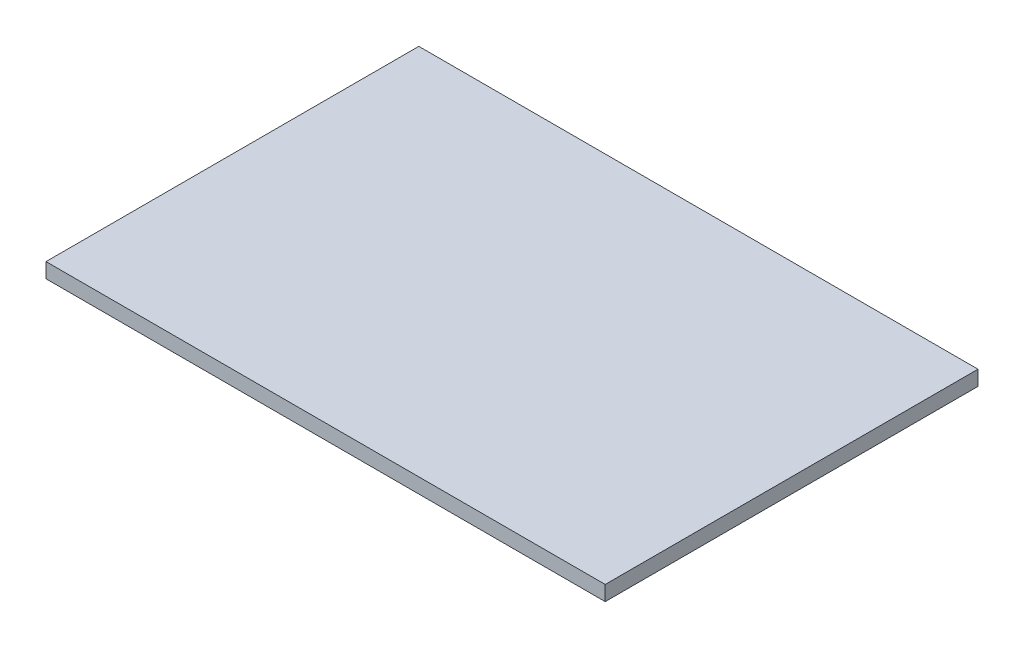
from build123d import *

# Parameters (mm, degrees)
ESQUISSE1_W      = 600
ESQUISSE1_H      = 400
EXTRUSION1_DEPTH = 16


with BuildPart() as part:
    # Esquisse1 → Extrusion1 (new body)
    with BuildSketch(Plane(origin=(0, 0, 0), x_dir=(1, 0, 0), z_dir=(0, 1, 0))):
        with Locations((300, 200)):
            Rectangle(ESQUISSE1_W, ESQUISSE1_H)
    extrude(amount=EXTRUSION1_DEPTH)


solid = part.part
